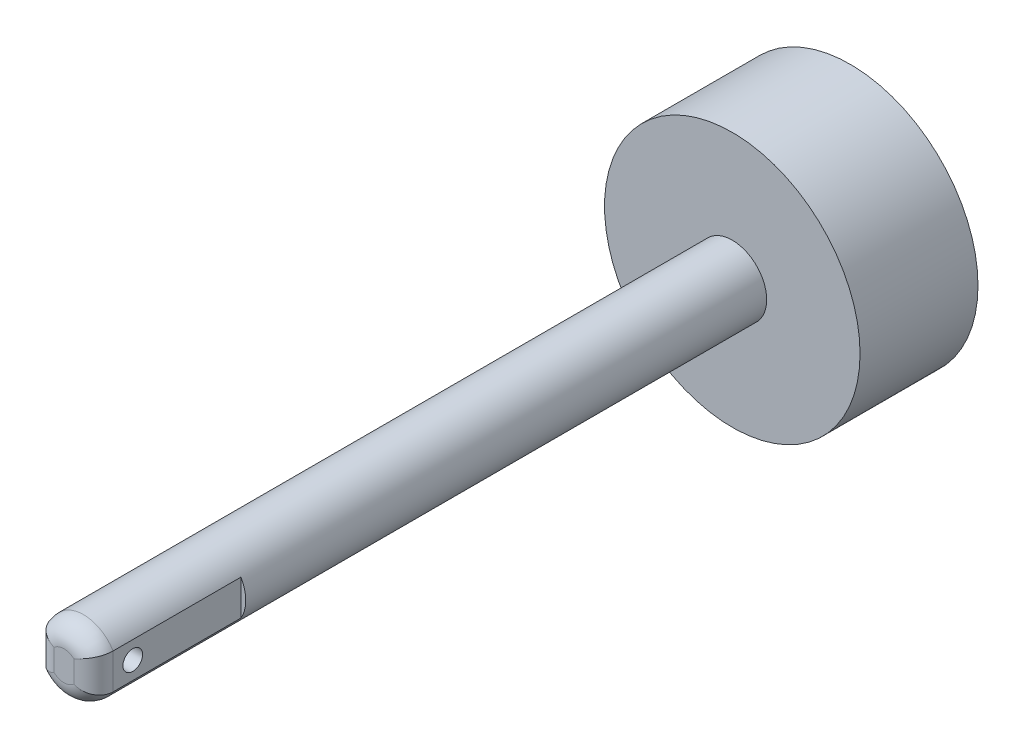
from build123d import *

# Parameters (mm, degrees)
ESQUISSE1_R             = 13
BASE_EXTRUSION_DEPTH    = 12
ESQUISSE2_R             = 3.5
BOSS_EXTRU_1_DEPTH      = 68
ESQUISSE3_W             = 4.230883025
ESQUISSE3_H             = 7.92329003
ENL_V_MAT_EXTRU_1_DEPTH = 15
ESQUISSE4_R             = 1
ENL_V_MAT_EXTRU_2_DEPTH = 83.613558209
CONG_1_R                = 2


with BuildPart() as part:
    # Esquisse1 → Base-Extrusion (new body)
    with BuildSketch(Plane.XY):
        Circle(ESQUISSE1_R)
    extrude(amount=BASE_EXTRUSION_DEPTH)

    # Esquisse2 → Boss.-Extru.1 (add)
    with BuildSketch(Plane.XY.offset(12)):
        with Locations(Location((0, 0, 0), (0, 0, 211.002719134))):
            Circle(ESQUISSE2_R)
    extrude(amount=BOSS_EXTRU_1_DEPTH)

    # Esquisse3 → Enl_v. mat.-Extru.1 (cut)
    with BuildSketch(Plane.XY.offset(80)):
        with Locations((-5.115441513, 0.115387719)):
            Rectangle(ESQUISSE3_W, ESQUISSE3_H)
        with Locations((5.115441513, 0.115387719)):
            Rectangle(ESQUISSE3_W, ESQUISSE3_H)
    extrude(amount=-ENL_V_MAT_EXTRU_1_DEPTH, mode=Mode.SUBTRACT)

    # Esquisse4 → Enl_v. mat.-Extru.2 (cut, through all)
    with BuildSketch(Plane(origin=(3, 0, 0), x_dir=(0, 0, -1), z_dir=(1, 0, 0))):
        with Locations(Location((-76, 0, 0), (0, 0, 90))):
            Circle(ESQUISSE4_R)
    extrude(amount=-ENL_V_MAT_EXTRU_2_DEPTH, mode=Mode.SUBTRACT)

    # Cong_1
    cong_1_edges = [part.edges().sort_by_distance(p)[0] for p in [
        (0, 3.5, 80),
        (0, -3.5, 80),
        (-3, 0, 80),
        (3, 0, 80),
    ]]
    fillet(cong_1_edges, radius=CONG_1_R)


solid = part.part
